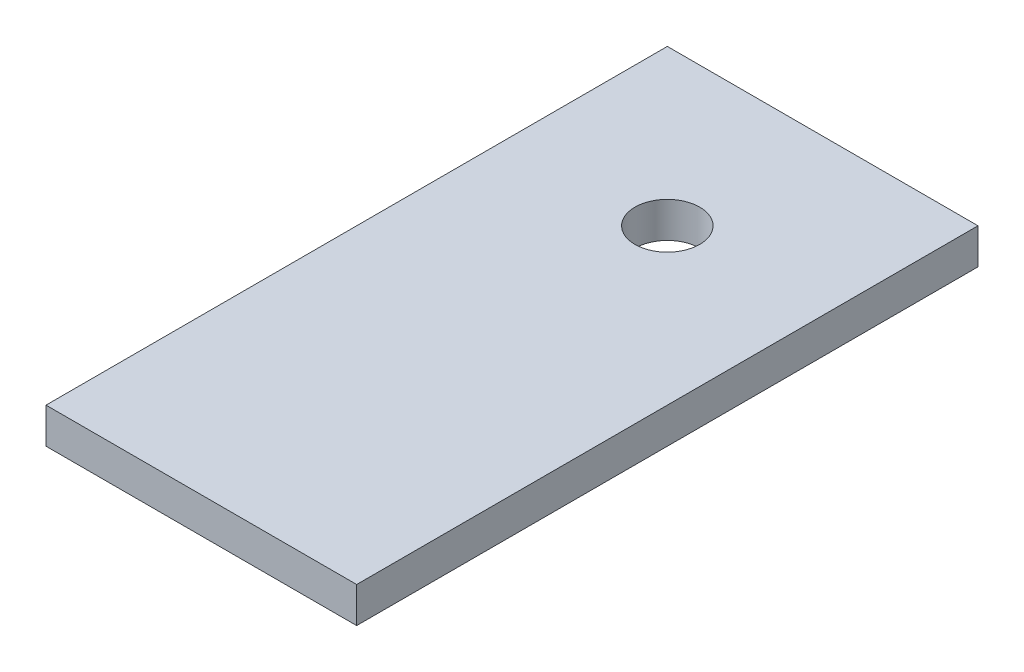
ISO-10303-21;
HEADER;
FILE_DESCRIPTION(('STEP AP214'),'2;1');
FILE_NAME('part.step','',(''),(''),'','','');
FILE_SCHEMA(('AUTOMOTIVE_DESIGN { 1 0 10303 214 1 1 1 1 }'));
ENDSEC;
DATA;
#1=APPLICATION_CONTEXT('core data for automotive mechanical design processes');
#2=APPLICATION_PROTOCOL_DEFINITION('international standard','automotive_design',2000,#1);
#3=PRODUCT_CONTEXT('',#1,'mechanical');
#4=PRODUCT('Part','Part','',(#3));
#5=PRODUCT_RELATED_PRODUCT_CATEGORY('part','',(#4));
#6=PRODUCT_DEFINITION_FORMATION('','',#4);
#7=PRODUCT_DEFINITION_CONTEXT('part definition',#1,'design');
#8=PRODUCT_DEFINITION('design','',#6,#7);
#9=PRODUCT_DEFINITION_SHAPE('','',#8);
#10=(LENGTH_UNIT() NAMED_UNIT(*) SI_UNIT(.MILLI.,.METRE.));
#11=(NAMED_UNIT(*) PLANE_ANGLE_UNIT() SI_UNIT($,.RADIAN.));
#12=(NAMED_UNIT(*) SI_UNIT($,.STERADIAN.) SOLID_ANGLE_UNIT());
#13=UNCERTAINTY_MEASURE_WITH_UNIT(LENGTH_MEASURE(1.E-05),#10,'distance_accuracy_value','');
#14=(GEOMETRIC_REPRESENTATION_CONTEXT(3) GLOBAL_UNCERTAINTY_ASSIGNED_CONTEXT((#13)) GLOBAL_UNIT_ASSIGNED_CONTEXT((#10,
#11,#12)) REPRESENTATION_CONTEXT('',''));
#15=CARTESIAN_POINT('',(0.,0.,0.));
#16=DIRECTION('',(0.,0.,1.));
#17=DIRECTION('',(1.,0.,0.));
#18=AXIS2_PLACEMENT_3D('',#15,#16,#17);
#19=CARTESIAN_POINT('',(-76.2,-8.73125,-304.8));
#20=DIRECTION('',(1.,0.,0.));
#21=DIRECTION('',(0.,0.,-1.));
#22=AXIS2_PLACEMENT_3D('',#19,#20,#21);
#23=PLANE('',#22);
#24=DIRECTION('',(0.,1.,0.));
#25=VECTOR('',#24,1.);
#26=CARTESIAN_POINT('',(-76.2,-8.73125,0.));
#27=LINE('',#26,#25);
#28=CARTESIAN_POINT('',(-76.2,-8.73125,0.));
#29=VERTEX_POINT('',#28);
#30=CARTESIAN_POINT('',(-76.2,8.73125,0.));
#31=VERTEX_POINT('',#30);
#32=EDGE_CURVE('E95',#29,#31,#27,.T.);
#33=ORIENTED_EDGE('',*,*,#32,.T.);
#34=DIRECTION('',(0.,0.,1.));
#35=VECTOR('',#34,1.);
#36=CARTESIAN_POINT('',(-76.2,8.73125,-304.8));
#37=LINE('',#36,#35);
#38=CARTESIAN_POINT('',(-76.2,8.73125,-304.8));
#39=VERTEX_POINT('',#38);
#40=EDGE_CURVE('E11',#39,#31,#37,.T.);
#41=ORIENTED_EDGE('',*,*,#40,.F.);
#42=DIRECTION('',(0.,1.,0.));
#43=VECTOR('',#42,1.);
#44=CARTESIAN_POINT('',(-76.2,-8.73125,-304.8));
#45=LINE('',#44,#43);
#46=CARTESIAN_POINT('',(-76.2,-8.73125,-304.8));
#47=VERTEX_POINT('',#46);
#48=EDGE_CURVE('E81',#47,#39,#45,.T.);
#49=ORIENTED_EDGE('',*,*,#48,.F.);
#50=DIRECTION('',(0.,0.,1.));
#51=VECTOR('',#50,1.);
#52=CARTESIAN_POINT('',(-76.2,-8.73125,-304.8));
#53=LINE('',#52,#51);
#54=EDGE_CURVE('E48',#47,#29,#53,.T.);
#55=ORIENTED_EDGE('',*,*,#54,.T.);
#56=EDGE_LOOP('',(#33,#41,#49,#55));
#57=FACE_BOUND('',#56,.T.);
#58=ADVANCED_FACE('F32',(#57),#23,.F.);
#59=CARTESIAN_POINT('',(-76.2,8.73125,-304.8));
#60=DIRECTION('',(0.,-1.,0.));
#61=DIRECTION('',(0.,0.,-1.));
#62=AXIS2_PLACEMENT_3D('',#59,#60,#61);
#63=PLANE('',#62);
#64=CARTESIAN_POINT('',(0.,8.73125,-228.6));
#65=DIRECTION('',(0.,1.,0.));
#66=DIRECTION('',(0.,0.,1.));
#67=AXIS2_PLACEMENT_3D('',#64,#65,#66);
#68=CIRCLE('',#67,15.875);
#69=CARTESIAN_POINT('',(0.,8.73125,-212.725));
#70=VERTEX_POINT('',#69);
#71=EDGE_CURVE('E107',#70,#70,#68,.T.);
#72=ORIENTED_EDGE('',*,*,#71,.F.);
#73=EDGE_LOOP('',(#72));
#74=FACE_BOUND('',#73,.T.);
#75=DIRECTION('',(1.,0.,0.));
#76=VECTOR('',#75,1.);
#77=CARTESIAN_POINT('',(-76.2,8.73125,0.));
#78=LINE('',#77,#76);
#79=CARTESIAN_POINT('',(76.2,8.73125,0.));
#80=VERTEX_POINT('',#79);
#81=EDGE_CURVE('E86',#31,#80,#78,.T.);
#82=ORIENTED_EDGE('',*,*,#81,.T.);
#83=DIRECTION('',(0.,0.,1.));
#84=VECTOR('',#83,1.);
#85=CARTESIAN_POINT('',(76.2,8.73125,-304.8));
#86=LINE('',#85,#84);
#87=CARTESIAN_POINT('',(76.2,8.73125,-304.8));
#88=VERTEX_POINT('',#87);
#89=EDGE_CURVE('E40',#88,#80,#86,.T.);
#90=ORIENTED_EDGE('',*,*,#89,.F.);
#91=DIRECTION('',(1.,0.,0.));
#92=VECTOR('',#91,1.);
#93=CARTESIAN_POINT('',(-76.2,8.73125,-304.8));
#94=LINE('',#93,#92);
#95=EDGE_CURVE('E73',#39,#88,#94,.T.);
#96=ORIENTED_EDGE('',*,*,#95,.F.);
#97=ORIENTED_EDGE('',*,*,#40,.T.);
#98=EDGE_LOOP('',(#82,#90,#96,#97));
#99=FACE_BOUND('',#98,.T.);
#100=ADVANCED_FACE('F85',(#74,#99),#63,.F.);
#101=CARTESIAN_POINT('',(76.2,-8.73125,-304.8));
#102=DIRECTION('',(1.,0.,0.));
#103=DIRECTION('',(0.,0.,-1.));
#104=AXIS2_PLACEMENT_3D('',#101,#102,#103);
#105=PLANE('',#104);
#106=DIRECTION('',(0.,1.,0.));
#107=VECTOR('',#106,1.);
#108=CARTESIAN_POINT('',(76.2,-8.73125,0.));
#109=LINE('',#108,#107);
#110=CARTESIAN_POINT('',(76.2,-8.73125,0.));
#111=VERTEX_POINT('',#110);
#112=EDGE_CURVE('E99',#111,#80,#109,.T.);
#113=ORIENTED_EDGE('',*,*,#112,.F.);
#114=DIRECTION('',(0.,0.,1.));
#115=VECTOR('',#114,1.);
#116=CARTESIAN_POINT('',(76.2,-8.73125,-304.8));
#117=LINE('',#116,#115);
#118=CARTESIAN_POINT('',(76.2,-8.73125,-304.8));
#119=VERTEX_POINT('',#118);
#120=EDGE_CURVE('E62',#119,#111,#117,.T.);
#121=ORIENTED_EDGE('',*,*,#120,.F.);
#122=DIRECTION('',(0.,1.,0.));
#123=VECTOR('',#122,1.);
#124=CARTESIAN_POINT('',(76.2,-8.73125,-304.8));
#125=LINE('',#124,#123);
#126=EDGE_CURVE('E80',#119,#88,#125,.T.);
#127=ORIENTED_EDGE('',*,*,#126,.T.);
#128=ORIENTED_EDGE('',*,*,#89,.T.);
#129=EDGE_LOOP('',(#113,#121,#127,#128));
#130=FACE_BOUND('',#129,.T.);
#131=ADVANCED_FACE('F89',(#130),#105,.T.);
#132=CARTESIAN_POINT('',(-76.2,-8.73125,-304.8));
#133=DIRECTION('',(0.,-1.,0.));
#134=DIRECTION('',(0.,0.,-1.));
#135=AXIS2_PLACEMENT_3D('',#132,#133,#134);
#136=PLANE('',#135);
#137=CARTESIAN_POINT('',(0.,-8.73125,-228.6));
#138=DIRECTION('',(0.,1.,0.));
#139=DIRECTION('',(0.,0.,1.));
#140=AXIS2_PLACEMENT_3D('',#137,#138,#139);
#141=CIRCLE('',#140,15.875);
#142=CARTESIAN_POINT('',(0.,-8.73125,-212.725));
#143=VERTEX_POINT('',#142);
#144=EDGE_CURVE('E97',#143,#143,#141,.T.);
#145=ORIENTED_EDGE('',*,*,#144,.T.);
#146=EDGE_LOOP('',(#145));
#147=FACE_BOUND('',#146,.T.);
#148=DIRECTION('',(1.,0.,0.));
#149=VECTOR('',#148,1.);
#150=CARTESIAN_POINT('',(-76.2,-8.73125,0.));
#151=LINE('',#150,#149);
#152=EDGE_CURVE('E101',#29,#111,#151,.T.);
#153=ORIENTED_EDGE('',*,*,#152,.F.);
#154=ORIENTED_EDGE('',*,*,#54,.F.);
#155=DIRECTION('',(1.,0.,0.));
#156=VECTOR('',#155,1.);
#157=CARTESIAN_POINT('',(-76.2,-8.73125,-304.8));
#158=LINE('',#157,#156);
#159=EDGE_CURVE('E90',#47,#119,#158,.T.);
#160=ORIENTED_EDGE('',*,*,#159,.T.);
#161=ORIENTED_EDGE('',*,*,#120,.T.);
#162=EDGE_LOOP('',(#153,#154,#160,#161));
#163=FACE_BOUND('',#162,.T.);
#164=ADVANCED_FACE('F113',(#147,#163),#136,.T.);
#165=CARTESIAN_POINT('',(0.,0.,-304.8));
#166=DIRECTION('',(0.,0.,-1.));
#167=DIRECTION('',(-1.,0.,0.));
#168=AXIS2_PLACEMENT_3D('',#165,#166,#167);
#169=PLANE('',#168);
#170=ORIENTED_EDGE('',*,*,#48,.T.);
#171=ORIENTED_EDGE('',*,*,#95,.T.);
#172=ORIENTED_EDGE('',*,*,#126,.F.);
#173=ORIENTED_EDGE('',*,*,#159,.F.);
#174=EDGE_LOOP('',(#170,#171,#172,#173));
#175=FACE_BOUND('',#174,.T.);
#176=ADVANCED_FACE('F77',(#175),#169,.T.);
#177=CARTESIAN_POINT('',(0.,0.,0.));
#178=DIRECTION('',(0.,0.,-1.));
#179=DIRECTION('',(-1.,0.,0.));
#180=AXIS2_PLACEMENT_3D('',#177,#178,#179);
#181=PLANE('',#180);
#182=ORIENTED_EDGE('',*,*,#32,.F.);
#183=ORIENTED_EDGE('',*,*,#152,.T.);
#184=ORIENTED_EDGE('',*,*,#112,.T.);
#185=ORIENTED_EDGE('',*,*,#81,.F.);
#186=EDGE_LOOP('',(#182,#183,#184,#185));
#187=FACE_BOUND('',#186,.T.);
#188=ADVANCED_FACE('F118',(#187),#181,.F.);
#189=CARTESIAN_POINT('',(0.,-8.73125,-228.6));
#190=DIRECTION('',(0.,1.,0.));
#191=DIRECTION('',(0.,0.,1.));
#192=AXIS2_PLACEMENT_3D('',#189,#190,#191);
#193=CYLINDRICAL_SURFACE('',#192,15.875);
#194=ORIENTED_EDGE('',*,*,#144,.F.);
#195=EDGE_LOOP('',(#194));
#196=FACE_BOUND('',#195,.T.);
#197=ORIENTED_EDGE('',*,*,#71,.T.);
#198=EDGE_LOOP('',(#197));
#199=FACE_BOUND('',#198,.T.);
#200=ADVANCED_FACE('F115',(#196,#199),#193,.F.);
#201=CLOSED_SHELL('',(#58,#100,#131,#164,#176,#188,#200));
#202=MANIFOLD_SOLID_BREP('B2',#201);
#203=ADVANCED_BREP_SHAPE_REPRESENTATION('',(#18,#202),#14);
#204=SHAPE_DEFINITION_REPRESENTATION(#9,#203);
ENDSEC;
END-ISO-10303-21;
